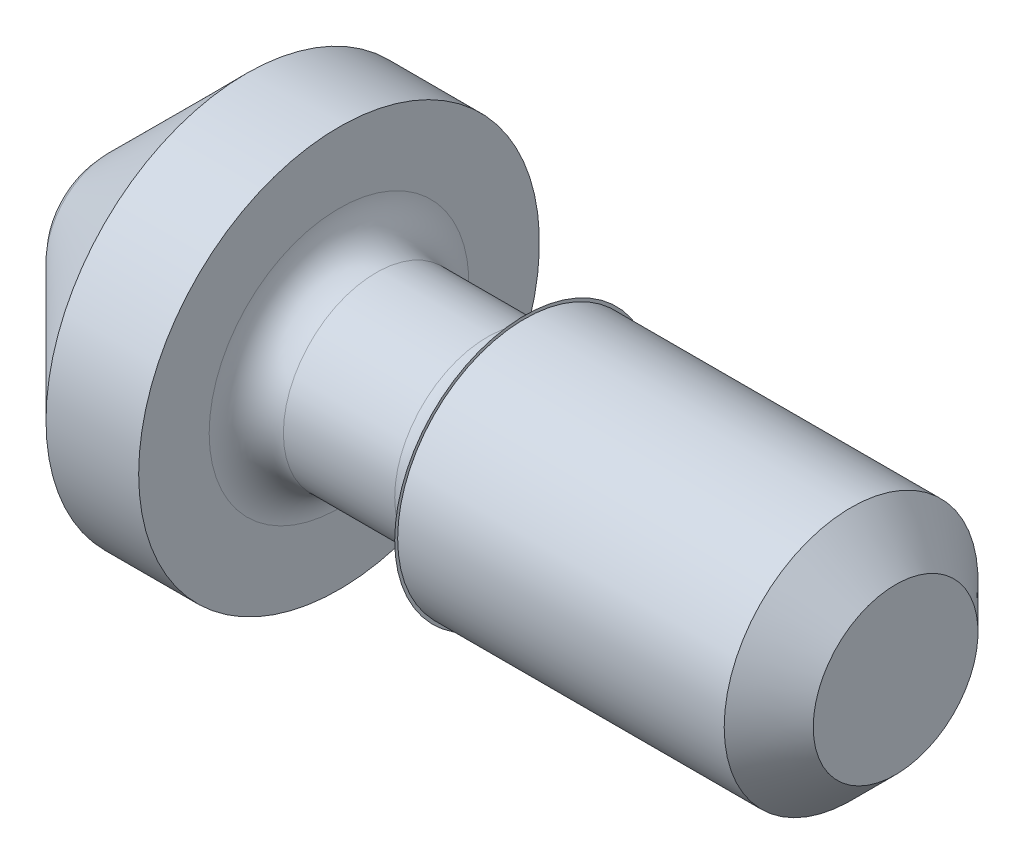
from build123d import *


with BuildPart() as part:
    # Sketch2 → Revolve1 (revolve)
    with BuildSketch(Plane.XY, mode=Mode.PRIVATE) as revolve1_sk:
        with BuildLine():
            Line((-0.762, 0), (-6.35, 0))
            Line((-6.35, 0), (-6.35, 0.0508))
            ThreePointArc((-6.35, 0.0508), (-6.535987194, -0.398212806), (-6.985, -0.5842))
            Line((-6.985, -0.5842), (-8.89, -0.5842))
            ThreePointArc((-8.89, -0.5842), (-9.339012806, -0.398212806), (-9.525, 0.0508))
            Line((-9.525, 0.0508), (-9.525, 1.2573))
            Line((-9.525, 1.2573), (-11.110630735, 1.2573))
            Line((-11.110630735, 1.2573), (-13.462, -1.094069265))
            ThreePointArc((-13.462, -1.094069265), (-13.792361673, -1.588490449), (-13.908369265, -2.1717))
            Line((-13.908369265, -2.1717), (0, -2.1717))
            Line((0, -2.1717), (0, -0.762))
            Line((0, -0.762), (-0.762, 0))
        make_face()
    revolve(revolve1_sk.sketch.rotate(Axis((-46.627868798, -2.1717, 0), (1, 0, 0)), 90), axis=Axis((-46.627868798, -2.1717, 0), (1, 0, 0)))


solid = part.part
